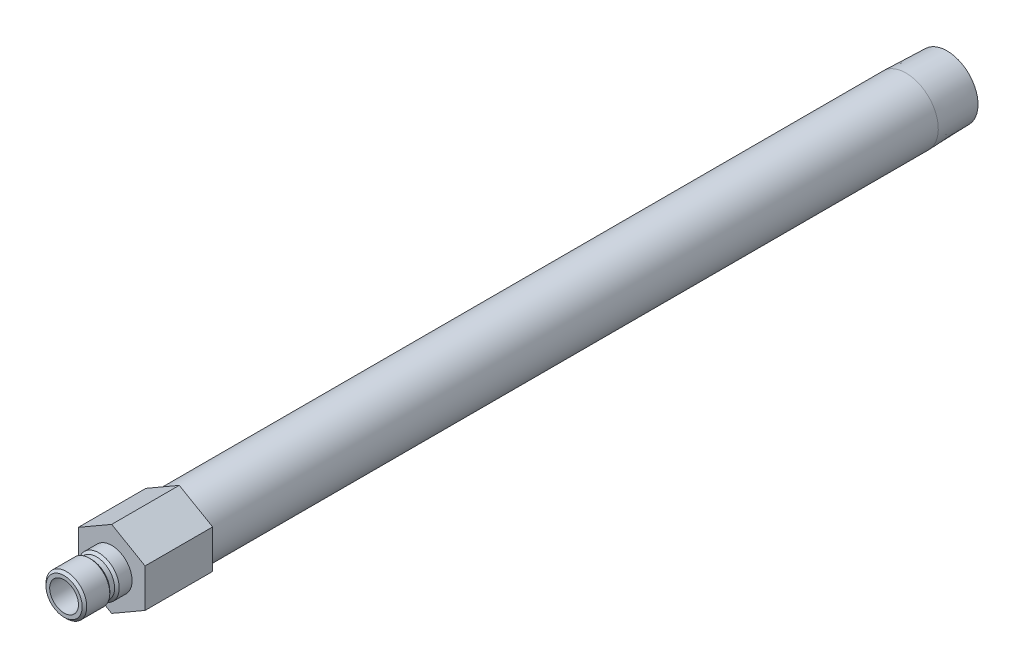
ISO-10303-21;
HEADER;
FILE_DESCRIPTION(('STEP AP214'),'2;1');
FILE_NAME('part.step','',(''),(''),'','','');
FILE_SCHEMA(('AUTOMOTIVE_DESIGN { 1 0 10303 214 1 1 1 1 }'));
ENDSEC;
DATA;
#1=APPLICATION_CONTEXT('core data for automotive mechanical design processes');
#2=APPLICATION_PROTOCOL_DEFINITION('international standard','automotive_design',2000,#1);
#3=PRODUCT_CONTEXT('',#1,'mechanical');
#4=PRODUCT('Part','Part','',(#3));
#5=PRODUCT_RELATED_PRODUCT_CATEGORY('part','',(#4));
#6=PRODUCT_DEFINITION_FORMATION('','',#4);
#7=PRODUCT_DEFINITION_CONTEXT('part definition',#1,'design');
#8=PRODUCT_DEFINITION('design','',#6,#7);
#9=PRODUCT_DEFINITION_SHAPE('','',#8);
#10=(LENGTH_UNIT() NAMED_UNIT(*) SI_UNIT(.MILLI.,.METRE.));
#11=(NAMED_UNIT(*) PLANE_ANGLE_UNIT() SI_UNIT($,.RADIAN.));
#12=(NAMED_UNIT(*) SI_UNIT($,.STERADIAN.) SOLID_ANGLE_UNIT());
#13=UNCERTAINTY_MEASURE_WITH_UNIT(LENGTH_MEASURE(1.E-05),#10,'distance_accuracy_value','');
#14=(GEOMETRIC_REPRESENTATION_CONTEXT(3) GLOBAL_UNCERTAINTY_ASSIGNED_CONTEXT((#13)) GLOBAL_UNIT_ASSIGNED_CONTEXT((#10,
#11,#12)) REPRESENTATION_CONTEXT('',''));
#15=CARTESIAN_POINT('',(0.,0.,0.));
#16=DIRECTION('',(0.,0.,1.));
#17=DIRECTION('',(1.,0.,0.));
#18=AXIS2_PLACEMENT_3D('',#15,#16,#17);
#19=CARTESIAN_POINT('',(0.,0.,0.));
#20=DIRECTION('',(0.,0.,-1.));
#21=DIRECTION('',(0.,1.,0.));
#22=AXIS2_PLACEMENT_3D('',#19,#20,#21);
#23=CYLINDRICAL_SURFACE('',#22,10.668);
#24=CARTESIAN_POINT('',(0.,0.,-262.7884));
#25=DIRECTION('',(0.,0.,-1.));
#26=DIRECTION('',(0.,1.,0.));
#27=AXIS2_PLACEMENT_3D('',#24,#25,#26);
#28=CIRCLE('',#27,10.6679999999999);
#29=CARTESIAN_POINT('',(0.,10.668,-262.7884));
#30=VERTEX_POINT('',#29);
#31=EDGE_CURVE('E168',#30,#30,#28,.T.);
#32=ORIENTED_EDGE('',*,*,#31,.F.);
#33=EDGE_LOOP('',(#32));
#34=FACE_BOUND('',#33,.T.);
#35=CARTESIAN_POINT('',(0.,0.,-22.352));
#36=DIRECTION('',(0.,0.,1.));
#37=DIRECTION('',(1.,0.,0.));
#38=AXIS2_PLACEMENT_3D('',#35,#36,#37);
#39=CIRCLE('',#38,10.668);
#40=CARTESIAN_POINT('',(10.668,0.,-22.352));
#41=VERTEX_POINT('',#40);
#42=EDGE_CURVE('E37',#41,#41,#39,.F.);
#43=ORIENTED_EDGE('',*,*,#42,.T.);
#44=EDGE_LOOP('',(#43));
#45=FACE_BOUND('',#44,.T.);
#46=ADVANCED_FACE('F33',(#34,#45),#23,.T.);
#47=CARTESIAN_POINT('',(0.,0.,0.));
#48=DIRECTION('',(0.,0.,-1.));
#49=DIRECTION('',(0.,1.,0.));
#50=AXIS2_PLACEMENT_3D('',#47,#48,#49);
#51=CYLINDRICAL_SURFACE('',#50,4.76249999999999);
#52=CARTESIAN_POINT('',(0.,0.,15.748));
#53=DIRECTION('',(0.,0.,-1.));
#54=DIRECTION('',(0.,1.,0.));
#55=AXIS2_PLACEMENT_3D('',#52,#53,#54);
#56=CIRCLE('',#55,4.7625);
#57=CARTESIAN_POINT('',(0.,4.7625,15.748));
#58=VERTEX_POINT('',#57);
#59=EDGE_CURVE('E144',#58,#58,#56,.T.);
#60=ORIENTED_EDGE('',*,*,#59,.F.);
#61=EDGE_LOOP('',(#60));
#62=FACE_BOUND('',#61,.T.);
#63=CARTESIAN_POINT('',(0.,0.,-22.352));
#64=DIRECTION('',(0.,0.,-1.));
#65=DIRECTION('',(0.,1.,0.));
#66=AXIS2_PLACEMENT_3D('',#63,#64,#65);
#67=CIRCLE('',#66,4.76249999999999);
#68=CARTESIAN_POINT('',(0.,4.7625,-22.352));
#69=VERTEX_POINT('',#68);
#70=EDGE_CURVE('E11',#69,#69,#67,.T.);
#71=ORIENTED_EDGE('',*,*,#70,.T.);
#72=EDGE_LOOP('',(#71));
#73=FACE_BOUND('',#72,.T.);
#74=ADVANCED_FACE('F35',(#62,#73),#51,.F.);
#75=CARTESIAN_POINT('',(0.,4.7625,-22.352));
#76=DIRECTION('',(0.,0.,-1.));
#77=DIRECTION('',(0.,1.,0.));
#78=AXIS2_PLACEMENT_3D('',#75,#76,#77);
#79=PLANE('',#78);
#80=CARTESIAN_POINT('',(0.,0.,-22.352));
#81=DIRECTION('',(0.,0.,-1.));
#82=DIRECTION('',(0.,1.,0.));
#83=AXIS2_PLACEMENT_3D('',#80,#81,#82);
#84=CIRCLE('',#83,7.89939999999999);
#85=CARTESIAN_POINT('',(0.,7.8994,-22.352));
#86=VERTEX_POINT('',#85);
#87=EDGE_CURVE('E43',#86,#86,#84,.T.);
#88=ORIENTED_EDGE('',*,*,#87,.T.);
#89=EDGE_LOOP('',(#88));
#90=FACE_BOUND('',#89,.T.);
#91=ORIENTED_EDGE('',*,*,#70,.F.);
#92=EDGE_LOOP('',(#91));
#93=FACE_BOUND('',#92,.T.);
#94=ADVANCED_FACE('F180',(#90,#93),#79,.T.);
#95=CARTESIAN_POINT('',(0.,0.,0.));
#96=DIRECTION('',(0.,0.,-1.));
#97=DIRECTION('',(0.,1.,0.));
#98=AXIS2_PLACEMENT_3D('',#95,#96,#97);
#99=CYLINDRICAL_SURFACE('',#98,7.89939999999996);
#100=CARTESIAN_POINT('',(0.,0.,-276.352));
#101=DIRECTION('',(0.,0.,-1.));
#102=DIRECTION('',(0.,1.,0.));
#103=AXIS2_PLACEMENT_3D('',#100,#101,#102);
#104=CIRCLE('',#103,7.89939999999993);
#105=CARTESIAN_POINT('',(0.,7.8994,-276.352));
#106=VERTEX_POINT('',#105);
#107=EDGE_CURVE('E174',#106,#106,#104,.T.);
#108=ORIENTED_EDGE('',*,*,#107,.T.);
#109=EDGE_LOOP('',(#108));
#110=FACE_BOUND('',#109,.T.);
#111=ORIENTED_EDGE('',*,*,#87,.F.);
#112=EDGE_LOOP('',(#111));
#113=FACE_BOUND('',#112,.T.);
#114=ADVANCED_FACE('F183',(#110,#113),#99,.F.);
#115=CARTESIAN_POINT('',(0.,10.244140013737,-276.352));
#116=DIRECTION('',(0.,0.,-1.));
#117=DIRECTION('',(0.,1.,0.));
#118=AXIS2_PLACEMENT_3D('',#115,#116,#117);
#119=PLANE('',#118);
#120=CARTESIAN_POINT('',(0.,0.,-276.352));
#121=DIRECTION('',(0.,0.,-1.));
#122=DIRECTION('',(0.,1.,0.));
#123=AXIS2_PLACEMENT_3D('',#120,#121,#122);
#124=CIRCLE('',#123,10.2441400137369);
#125=CARTESIAN_POINT('',(0.,10.244140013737,-276.352));
#126=VERTEX_POINT('',#125);
#127=EDGE_CURVE('E171',#126,#126,#124,.T.);
#128=ORIENTED_EDGE('',*,*,#127,.T.);
#129=EDGE_LOOP('',(#128));
#130=FACE_BOUND('',#129,.T.);
#131=ORIENTED_EDGE('',*,*,#107,.F.);
#132=EDGE_LOOP('',(#131));
#133=FACE_BOUND('',#132,.T.);
#134=ADVANCED_FACE('F185',(#130,#133),#119,.T.);
#135=CARTESIAN_POINT('',(0.,0.,-276.352));
#136=DIRECTION('',(0.,0.,1.));
#137=DIRECTION('',(0.,-1.,0.));
#138=AXIS2_PLACEMENT_3D('',#135,#136,#137);
#139=CONICAL_SURFACE('',#138,10.2441400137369,0.0312396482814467);
#140=ORIENTED_EDGE('',*,*,#31,.T.);
#141=EDGE_LOOP('',(#140));
#142=FACE_BOUND('',#141,.T.);
#143=ORIENTED_EDGE('',*,*,#127,.F.);
#144=EDGE_LOOP('',(#143));
#145=FACE_BOUND('',#144,.T.);
#146=ADVANCED_FACE('F192',(#142,#145),#139,.T.);
#147=CARTESIAN_POINT('',(0.,6.7437,0.));
#148=DIRECTION('',(0.,0.,1.));
#149=DIRECTION('',(0.,-1.,0.));
#150=AXIS2_PLACEMENT_3D('',#147,#148,#149);
#151=PLANE('',#150);
#152=CARTESIAN_POINT('',(0.,0.,0.));
#153=DIRECTION('',(0.,0.,-1.));
#154=DIRECTION('',(0.,1.,0.));
#155=AXIS2_PLACEMENT_3D('',#152,#153,#154);
#156=CIRCLE('',#155,6.7437);
#157=CARTESIAN_POINT('',(0.,6.7437,0.));
#158=VERTEX_POINT('',#157);
#159=EDGE_CURVE('E165',#158,#158,#156,.T.);
#160=ORIENTED_EDGE('',*,*,#159,.T.);
#161=EDGE_LOOP('',(#160));
#162=FACE_BOUND('',#161,.T.);
#163=DIRECTION('',(-0.866025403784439,-0.5,0.));
#164=VECTOR('',#163,1.);
#165=CARTESIAN_POINT('',(0.,12.7582862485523,0.));
#166=LINE('',#165,#164);
#167=CARTESIAN_POINT('',(0.,12.7582862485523,0.));
#168=VERTEX_POINT('',#167);
#169=CARTESIAN_POINT('',(-11.049,6.37914312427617,0.));
#170=VERTEX_POINT('',#169);
#171=EDGE_CURVE('E122',#168,#170,#166,.T.);
#172=ORIENTED_EDGE('',*,*,#171,.T.);
#173=DIRECTION('',(0.,-1.,0.));
#174=VECTOR('',#173,1.);
#175=CARTESIAN_POINT('',(-11.049,6.37914312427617,0.));
#176=LINE('',#175,#174);
#177=CARTESIAN_POINT('',(-11.049,-6.37914312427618,0.));
#178=VERTEX_POINT('',#177);
#179=EDGE_CURVE('E125',#170,#178,#176,.T.);
#180=ORIENTED_EDGE('',*,*,#179,.T.);
#181=DIRECTION('',(0.866025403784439,-0.5,0.));
#182=VECTOR('',#181,1.);
#183=CARTESIAN_POINT('',(-11.049,-6.37914312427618,0.));
#184=LINE('',#183,#182);
#185=CARTESIAN_POINT('',(0.,-12.7582862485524,0.));
#186=VERTEX_POINT('',#185);
#187=EDGE_CURVE('E128',#178,#186,#184,.T.);
#188=ORIENTED_EDGE('',*,*,#187,.T.);
#189=DIRECTION('',(0.866025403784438,0.5,0.));
#190=VECTOR('',#189,1.);
#191=CARTESIAN_POINT('',(0.,-12.7582862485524,0.));
#192=LINE('',#191,#190);
#193=CARTESIAN_POINT('',(11.049,-6.37914312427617,0.));
#194=VERTEX_POINT('',#193);
#195=EDGE_CURVE('E131',#186,#194,#192,.T.);
#196=ORIENTED_EDGE('',*,*,#195,.T.);
#197=DIRECTION('',(0.,1.,0.));
#198=VECTOR('',#197,1.);
#199=CARTESIAN_POINT('',(11.049,-6.37914312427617,0.));
#200=LINE('',#199,#198);
#201=CARTESIAN_POINT('',(11.049,6.37914312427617,0.));
#202=VERTEX_POINT('',#201);
#203=EDGE_CURVE('E99',#194,#202,#200,.T.);
#204=ORIENTED_EDGE('',*,*,#203,.T.);
#205=DIRECTION('',(-0.866025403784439,0.5,0.));
#206=VECTOR('',#205,1.);
#207=CARTESIAN_POINT('',(11.049,6.37914312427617,0.));
#208=LINE('',#207,#206);
#209=EDGE_CURVE('E134',#202,#168,#208,.T.);
#210=ORIENTED_EDGE('',*,*,#209,.T.);
#211=EDGE_LOOP('',(#172,#180,#188,#196,#204,#210));
#212=FACE_BOUND('',#211,.T.);
#213=ADVANCED_FACE('F206',(#162,#212),#151,.T.);
#214=CARTESIAN_POINT('',(0.,0.,0.));
#215=DIRECTION('',(0.,0.,-1.));
#216=DIRECTION('',(0.,1.,0.));
#217=AXIS2_PLACEMENT_3D('',#214,#215,#216);
#218=CYLINDRICAL_SURFACE('',#217,6.7437);
#219=CARTESIAN_POINT('',(0.,0.,4.25449999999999));
#220=DIRECTION('',(0.,0.,-1.));
#221=DIRECTION('',(0.,1.,0.));
#222=AXIS2_PLACEMENT_3D('',#219,#220,#221);
#223=CIRCLE('',#222,6.7437);
#224=CARTESIAN_POINT('',(0.,6.7437,4.25449999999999));
#225=VERTEX_POINT('',#224);
#226=EDGE_CURVE('E162',#225,#225,#223,.T.);
#227=ORIENTED_EDGE('',*,*,#226,.T.);
#228=EDGE_LOOP('',(#227));
#229=FACE_BOUND('',#228,.T.);
#230=ORIENTED_EDGE('',*,*,#159,.F.);
#231=EDGE_LOOP('',(#230));
#232=FACE_BOUND('',#231,.T.);
#233=ADVANCED_FACE('F213',(#229,#232),#218,.T.);
#234=CARTESIAN_POINT('',(0.,0.,4.25449999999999));
#235=DIRECTION('',(0.,0.,-1.));
#236=DIRECTION('',(0.,1.,0.));
#237=AXIS2_PLACEMENT_3D('',#234,#235,#236);
#238=CONICAL_SURFACE('',#237,6.7437,0.785398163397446);
#239=CARTESIAN_POINT('',(0.,0.,5.0165));
#240=DIRECTION('',(0.,0.,-1.));
#241=DIRECTION('',(0.,1.,0.));
#242=AXIS2_PLACEMENT_3D('',#239,#240,#241);
#243=CIRCLE('',#242,5.9817);
#244=CARTESIAN_POINT('',(0.,5.9817,5.0165));
#245=VERTEX_POINT('',#244);
#246=EDGE_CURVE('E159',#245,#245,#243,.T.);
#247=ORIENTED_EDGE('',*,*,#246,.T.);
#248=EDGE_LOOP('',(#247));
#249=FACE_BOUND('',#248,.T.);
#250=ORIENTED_EDGE('',*,*,#226,.F.);
#251=EDGE_LOOP('',(#250));
#252=FACE_BOUND('',#251,.T.);
#253=ADVANCED_FACE('F222',(#249,#252),#238,.T.);
#254=CARTESIAN_POINT('',(0.,0.,0.));
#255=DIRECTION('',(0.,0.,-1.));
#256=DIRECTION('',(0.,1.,0.));
#257=AXIS2_PLACEMENT_3D('',#254,#255,#256);
#258=CYLINDRICAL_SURFACE('',#257,5.9817);
#259=CARTESIAN_POINT('',(0.,0.,6.604));
#260=DIRECTION('',(0.,0.,-1.));
#261=DIRECTION('',(0.,1.,0.));
#262=AXIS2_PLACEMENT_3D('',#259,#260,#261);
#263=CIRCLE('',#262,5.9817);
#264=CARTESIAN_POINT('',(0.,5.9817,6.604));
#265=VERTEX_POINT('',#264);
#266=EDGE_CURVE('E156',#265,#265,#263,.T.);
#267=ORIENTED_EDGE('',*,*,#266,.T.);
#268=EDGE_LOOP('',(#267));
#269=FACE_BOUND('',#268,.T.);
#270=ORIENTED_EDGE('',*,*,#246,.F.);
#271=EDGE_LOOP('',(#270));
#272=FACE_BOUND('',#271,.T.);
#273=ADVANCED_FACE('F263',(#269,#272),#258,.T.);
#274=CARTESIAN_POINT('',(0.,0.,6.604));
#275=DIRECTION('',(0.,0.,1.));
#276=DIRECTION('',(0.,-1.,0.));
#277=AXIS2_PLACEMENT_3D('',#274,#275,#276);
#278=CONICAL_SURFACE('',#277,5.9817,0.785398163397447);
#279=CARTESIAN_POINT('',(0.,0.,7.366));
#280=DIRECTION('',(0.,0.,-1.));
#281=DIRECTION('',(0.,1.,0.));
#282=AXIS2_PLACEMENT_3D('',#279,#280,#281);
#283=CIRCLE('',#282,6.7437);
#284=CARTESIAN_POINT('',(0.,6.7437,7.366));
#285=VERTEX_POINT('',#284);
#286=EDGE_CURVE('E153',#285,#285,#283,.T.);
#287=ORIENTED_EDGE('',*,*,#286,.T.);
#288=EDGE_LOOP('',(#287));
#289=FACE_BOUND('',#288,.T.);
#290=ORIENTED_EDGE('',*,*,#266,.F.);
#291=EDGE_LOOP('',(#290));
#292=FACE_BOUND('',#291,.T.);
#293=ADVANCED_FACE('F259',(#289,#292),#278,.T.);
#294=CARTESIAN_POINT('',(0.,0.,0.));
#295=DIRECTION('',(0.,0.,-1.));
#296=DIRECTION('',(0.,1.,0.));
#297=AXIS2_PLACEMENT_3D('',#294,#295,#296);
#298=CYLINDRICAL_SURFACE('',#297,6.7437);
#299=CARTESIAN_POINT('',(0.,0.,14.986));
#300=DIRECTION('',(0.,0.,-1.));
#301=DIRECTION('',(0.,1.,0.));
#302=AXIS2_PLACEMENT_3D('',#299,#300,#301);
#303=CIRCLE('',#302,6.7437);
#304=CARTESIAN_POINT('',(0.,6.7437,14.986));
#305=VERTEX_POINT('',#304);
#306=EDGE_CURVE('E150',#305,#305,#303,.T.);
#307=ORIENTED_EDGE('',*,*,#306,.T.);
#308=EDGE_LOOP('',(#307));
#309=FACE_BOUND('',#308,.T.);
#310=ORIENTED_EDGE('',*,*,#286,.F.);
#311=EDGE_LOOP('',(#310));
#312=FACE_BOUND('',#311,.T.);
#313=ADVANCED_FACE('F255',(#309,#312),#298,.T.);
#314=CARTESIAN_POINT('',(0.,0.,14.986));
#315=DIRECTION('',(0.,0.,-1.));
#316=DIRECTION('',(0.,1.,0.));
#317=AXIS2_PLACEMENT_3D('',#314,#315,#316);
#318=CONICAL_SURFACE('',#317,6.7437,0.785398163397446);
#319=CARTESIAN_POINT('',(0.,0.,15.748));
#320=DIRECTION('',(0.,0.,-1.));
#321=DIRECTION('',(0.,1.,0.));
#322=AXIS2_PLACEMENT_3D('',#319,#320,#321);
#323=CIRCLE('',#322,5.9817);
#324=CARTESIAN_POINT('',(0.,5.9817,15.748));
#325=VERTEX_POINT('',#324);
#326=EDGE_CURVE('E147',#325,#325,#323,.T.);
#327=ORIENTED_EDGE('',*,*,#326,.T.);
#328=EDGE_LOOP('',(#327));
#329=FACE_BOUND('',#328,.T.);
#330=ORIENTED_EDGE('',*,*,#306,.F.);
#331=EDGE_LOOP('',(#330));
#332=FACE_BOUND('',#331,.T.);
#333=ADVANCED_FACE('F251',(#329,#332),#318,.T.);
#334=CARTESIAN_POINT('',(0.,4.7625,15.748));
#335=DIRECTION('',(0.,0.,1.));
#336=DIRECTION('',(0.,-1.,0.));
#337=AXIS2_PLACEMENT_3D('',#334,#335,#336);
#338=PLANE('',#337);
#339=ORIENTED_EDGE('',*,*,#59,.T.);
#340=EDGE_LOOP('',(#339));
#341=FACE_BOUND('',#340,.T.);
#342=ORIENTED_EDGE('',*,*,#326,.F.);
#343=EDGE_LOOP('',(#342));
#344=FACE_BOUND('',#343,.T.);
#345=ADVANCED_FACE('F239',(#341,#344),#338,.T.);
#346=CARTESIAN_POINT('',(0.,12.7582862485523,-22.352));
#347=DIRECTION('',(-0.5,0.866025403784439,0.));
#348=DIRECTION('',(-0.866025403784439,-0.5,0.));
#349=AXIS2_PLACEMENT_3D('',#346,#347,#348);
#350=PLANE('',#349);
#351=ORIENTED_EDGE('',*,*,#171,.F.);
#352=DIRECTION('',(0.,0.,1.));
#353=VECTOR('',#352,1.);
#354=CARTESIAN_POINT('',(0.,12.7582862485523,-22.352));
#355=LINE('',#354,#353);
#356=CARTESIAN_POINT('',(0.,12.7582862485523,-22.352));
#357=VERTEX_POINT('',#356);
#358=EDGE_CURVE('E51',#357,#168,#355,.T.);
#359=ORIENTED_EDGE('',*,*,#358,.F.);
#360=DIRECTION('',(-0.866025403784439,-0.5,0.));
#361=VECTOR('',#360,1.);
#362=CARTESIAN_POINT('',(0.,12.7582862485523,-22.352));
#363=LINE('',#362,#361);
#364=CARTESIAN_POINT('',(-11.049,6.37914312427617,-22.352));
#365=VERTEX_POINT('',#364);
#366=EDGE_CURVE('E137',#357,#365,#363,.T.);
#367=ORIENTED_EDGE('',*,*,#366,.T.);
#368=DIRECTION('',(0.,0.,1.));
#369=VECTOR('',#368,1.);
#370=CARTESIAN_POINT('',(-11.049,6.37914312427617,-22.352));
#371=LINE('',#370,#369);
#372=EDGE_CURVE('E86',#365,#170,#371,.T.);
#373=ORIENTED_EDGE('',*,*,#372,.T.);
#374=EDGE_LOOP('',(#351,#359,#367,#373));
#375=FACE_BOUND('',#374,.T.);
#376=ADVANCED_FACE('F226',(#375),#350,.T.);
#377=CARTESIAN_POINT('',(11.049,6.37914312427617,-22.352));
#378=DIRECTION('',(0.5,0.866025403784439,0.));
#379=DIRECTION('',(-0.866025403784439,0.5,0.));
#380=AXIS2_PLACEMENT_3D('',#377,#378,#379);
#381=PLANE('',#380);
#382=ORIENTED_EDGE('',*,*,#209,.F.);
#383=DIRECTION('',(0.,0.,1.));
#384=VECTOR('',#383,1.);
#385=CARTESIAN_POINT('',(11.049,6.37914312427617,-22.352));
#386=LINE('',#385,#384);
#387=CARTESIAN_POINT('',(11.049,6.37914312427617,-22.352));
#388=VERTEX_POINT('',#387);
#389=EDGE_CURVE('E74',#388,#202,#386,.T.);
#390=ORIENTED_EDGE('',*,*,#389,.F.);
#391=DIRECTION('',(-0.866025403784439,0.5,0.));
#392=VECTOR('',#391,1.);
#393=CARTESIAN_POINT('',(11.049,6.37914312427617,-22.352));
#394=LINE('',#393,#392);
#395=EDGE_CURVE('E112',#388,#357,#394,.T.);
#396=ORIENTED_EDGE('',*,*,#395,.T.);
#397=ORIENTED_EDGE('',*,*,#358,.T.);
#398=EDGE_LOOP('',(#382,#390,#396,#397));
#399=FACE_BOUND('',#398,.T.);
#400=ADVANCED_FACE('F231',(#399),#381,.T.);
#401=CARTESIAN_POINT('',(11.049,-6.37914312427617,-22.352));
#402=DIRECTION('',(1.,0.,0.));
#403=DIRECTION('',(0.,0.,-1.));
#404=AXIS2_PLACEMENT_3D('',#401,#402,#403);
#405=PLANE('',#404);
#406=ORIENTED_EDGE('',*,*,#203,.F.);
#407=DIRECTION('',(0.,0.,1.));
#408=VECTOR('',#407,1.);
#409=CARTESIAN_POINT('',(11.049,-6.37914312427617,-22.352));
#410=LINE('',#409,#408);
#411=CARTESIAN_POINT('',(11.049,-6.37914312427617,-22.352));
#412=VERTEX_POINT('',#411);
#413=EDGE_CURVE('E94',#412,#194,#410,.T.);
#414=ORIENTED_EDGE('',*,*,#413,.F.);
#415=DIRECTION('',(0.,1.,0.));
#416=VECTOR('',#415,1.);
#417=CARTESIAN_POINT('',(11.049,-6.37914312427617,-22.352));
#418=LINE('',#417,#416);
#419=EDGE_CURVE('E97',#412,#388,#418,.T.);
#420=ORIENTED_EDGE('',*,*,#419,.T.);
#421=ORIENTED_EDGE('',*,*,#389,.T.);
#422=EDGE_LOOP('',(#406,#414,#420,#421));
#423=FACE_BOUND('',#422,.T.);
#424=ADVANCED_FACE('F96',(#423),#405,.T.);
#425=CARTESIAN_POINT('',(0.,-12.7582862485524,-22.352));
#426=DIRECTION('',(0.5,-0.866025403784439,0.));
#427=DIRECTION('',(0.866025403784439,0.5,0.));
#428=AXIS2_PLACEMENT_3D('',#425,#426,#427);
#429=PLANE('',#428);
#430=ORIENTED_EDGE('',*,*,#195,.F.);
#431=DIRECTION('',(0.,0.,1.));
#432=VECTOR('',#431,1.);
#433=CARTESIAN_POINT('',(0.,-12.7582862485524,-22.352));
#434=LINE('',#433,#432);
#435=CARTESIAN_POINT('',(0.,-12.7582862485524,-22.352));
#436=VERTEX_POINT('',#435);
#437=EDGE_CURVE('E104',#436,#186,#434,.T.);
#438=ORIENTED_EDGE('',*,*,#437,.F.);
#439=DIRECTION('',(0.866025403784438,0.5,0.));
#440=VECTOR('',#439,1.);
#441=CARTESIAN_POINT('',(0.,-12.7582862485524,-22.352));
#442=LINE('',#441,#440);
#443=EDGE_CURVE('E110',#436,#412,#442,.T.);
#444=ORIENTED_EDGE('',*,*,#443,.T.);
#445=ORIENTED_EDGE('',*,*,#413,.T.);
#446=EDGE_LOOP('',(#430,#438,#444,#445));
#447=FACE_BOUND('',#446,.T.);
#448=ADVANCED_FACE('F114',(#447),#429,.T.);
#449=CARTESIAN_POINT('',(-11.049,-6.37914312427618,-22.352));
#450=DIRECTION('',(-0.5,-0.866025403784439,0.));
#451=DIRECTION('',(0.866025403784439,-0.5,0.));
#452=AXIS2_PLACEMENT_3D('',#449,#450,#451);
#453=PLANE('',#452);
#454=ORIENTED_EDGE('',*,*,#187,.F.);
#455=DIRECTION('',(0.,0.,1.));
#456=VECTOR('',#455,1.);
#457=CARTESIAN_POINT('',(-11.049,-6.37914312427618,-22.352));
#458=LINE('',#457,#456);
#459=CARTESIAN_POINT('',(-11.049,-6.37914312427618,-22.352));
#460=VERTEX_POINT('',#459);
#461=EDGE_CURVE('E141',#460,#178,#458,.T.);
#462=ORIENTED_EDGE('',*,*,#461,.F.);
#463=DIRECTION('',(0.866025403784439,-0.5,0.));
#464=VECTOR('',#463,1.);
#465=CARTESIAN_POINT('',(-11.049,-6.37914312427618,-22.352));
#466=LINE('',#465,#464);
#467=EDGE_CURVE('E115',#460,#436,#466,.T.);
#468=ORIENTED_EDGE('',*,*,#467,.T.);
#469=ORIENTED_EDGE('',*,*,#437,.T.);
#470=EDGE_LOOP('',(#454,#462,#468,#469));
#471=FACE_BOUND('',#470,.T.);
#472=ADVANCED_FACE('F230',(#471),#453,.T.);
#473=CARTESIAN_POINT('',(-11.049,6.37914312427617,-22.352));
#474=DIRECTION('',(-1.,0.,0.));
#475=DIRECTION('',(0.,0.,1.));
#476=AXIS2_PLACEMENT_3D('',#473,#474,#475);
#477=PLANE('',#476);
#478=ORIENTED_EDGE('',*,*,#179,.F.);
#479=ORIENTED_EDGE('',*,*,#372,.F.);
#480=DIRECTION('',(0.,-1.,0.));
#481=VECTOR('',#480,1.);
#482=CARTESIAN_POINT('',(-11.049,6.37914312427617,-22.352));
#483=LINE('',#482,#481);
#484=EDGE_CURVE('E117',#365,#460,#483,.T.);
#485=ORIENTED_EDGE('',*,*,#484,.T.);
#486=ORIENTED_EDGE('',*,*,#461,.T.);
#487=EDGE_LOOP('',(#478,#479,#485,#486));
#488=FACE_BOUND('',#487,.T.);
#489=ADVANCED_FACE('F227',(#488),#477,.T.);
#490=CARTESIAN_POINT('',(-11.049,6.37914312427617,-22.352));
#491=DIRECTION('',(0.,0.,1.));
#492=DIRECTION('',(1.,0.,0.));
#493=AXIS2_PLACEMENT_3D('',#490,#491,#492);
#494=PLANE('',#493);
#495=ORIENTED_EDGE('',*,*,#42,.F.);
#496=EDGE_LOOP('',(#495));
#497=FACE_BOUND('',#496,.T.);
#498=ORIENTED_EDGE('',*,*,#366,.F.);
#499=ORIENTED_EDGE('',*,*,#395,.F.);
#500=ORIENTED_EDGE('',*,*,#419,.F.);
#501=ORIENTED_EDGE('',*,*,#443,.F.);
#502=ORIENTED_EDGE('',*,*,#467,.F.);
#503=ORIENTED_EDGE('',*,*,#484,.F.);
#504=EDGE_LOOP('',(#498,#499,#500,#501,#502,#503));
#505=FACE_BOUND('',#504,.T.);
#506=ADVANCED_FACE('F108',(#497,#505),#494,.F.);
#507=CLOSED_SHELL('',(#46,#74,#94,#114,#134,#146,#213,#233,#253,#273,#293,#313,#333,#345,#376,
#400,#424,#448,#472,#489,#506));
#508=MANIFOLD_SOLID_BREP('B2',#507);
#509=ADVANCED_BREP_SHAPE_REPRESENTATION('',(#18,#508),#14);
#510=SHAPE_DEFINITION_REPRESENTATION(#9,#509);
ENDSEC;
END-ISO-10303-21;
